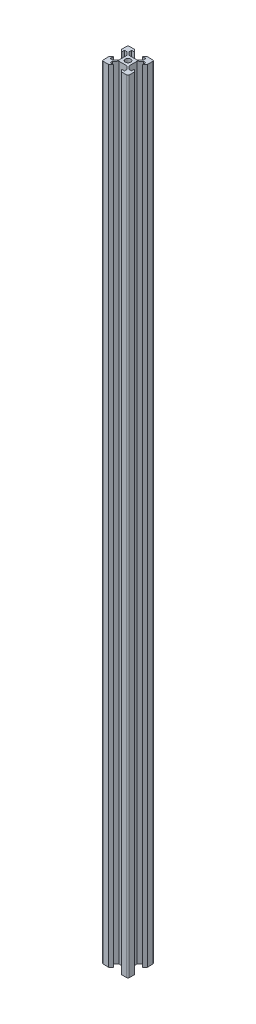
from build123d import *

# Parameters (mm, degrees)
SKETCH1_R           = 2.1
BOSS_EXTRUDE1_DEPTH = 600
FILLET1_R           = 1


with BuildPart() as part:
    # Sketch1 → Boss-Extrude1 (new body)
    with BuildSketch(Plane(origin=(0, 0, 0), x_dir=(1, 0, 0), z_dir=(0, 1, 0))):
        Polygon((6.819710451, -3.591375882), (4.304204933, -1.164549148), (4.304204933, 4.965450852), (6.819710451, 7.400450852), (8.604204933, 7.400450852), (8.604204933, 4.965450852), (10.404204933, 6.750450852), (10.404204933, 11.900450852), (5.904204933, 11.900450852), (5.254204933, 11.900450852), (3.469204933, 10.100450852), (5.904204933, 10.100450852), (5.904204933, 8.31595637), (3.469204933, 5.800450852), (-2.660795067, 5.800450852), (-5.087621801, 8.31595637), (-5.087621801, 10.100450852), (-2.660795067, 10.100450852), (-4.445795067, 11.900450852), (-5.095795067, 11.900450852), (-9.595795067, 11.900450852), (-9.595795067, 6.750450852), (-7.795795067, 4.965450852), (-7.795795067, 7.400450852), (-6.011300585, 7.400450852), (-3.495795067, 4.965450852), (-3.495795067, -1.164549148), (-6.011300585, -3.591375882), (-7.795795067, -3.591375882), (-7.795795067, -1.164549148), (-9.595795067, -2.949549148), (-9.595795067, -8.099549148), (-5.087621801, -8.099549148), (-4.445795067, -8.099549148), (-2.660795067, -6.299549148), (-5.087621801, -6.299549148), (-5.087621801, -4.515054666), (-2.660795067, -1.999549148), (3.469204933, -1.999549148), (5.904204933, -4.515054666), (5.904204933, -6.299549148), (3.469204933, -6.299549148), (5.254204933, -8.099549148), (5.904204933, -8.099549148), (10.404204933, -8.099549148), (10.404204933, -2.949549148), (8.604204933, -1.164549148), (8.604204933, -3.591375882), align=None)
        with Locations(Location((0.404204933, 1.900450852, 0), (0, 0, 270))):
            Circle(SKETCH1_R, mode=Mode.SUBTRACT)
    extrude(amount=BOSS_EXTRUDE1_DEPTH)

    # Fillet1
    fillet1_edges = [part.edges().sort_by_distance(p)[0] for p in [
        (-9.595795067, 300, -11.900450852),
        (10.404204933, 300, -11.900450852),
        (10.404204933, 300, 8.099549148),
        (-9.595795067, 300, 8.099549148),
    ]]
    fillet(fillet1_edges, radius=FILLET1_R)


solid = part.part
